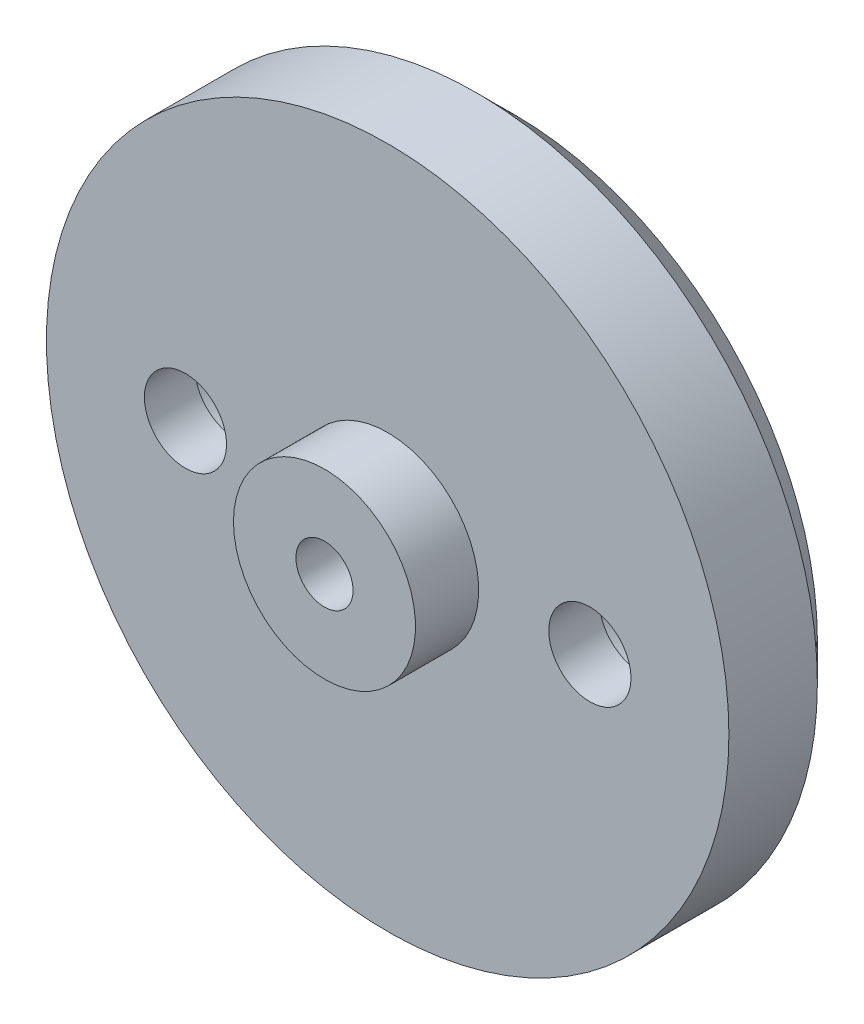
ISO-10303-21;
HEADER;
FILE_DESCRIPTION(('STEP AP214'),'2;1');
FILE_NAME('part.step','',(''),(''),'','','');
FILE_SCHEMA(('AUTOMOTIVE_DESIGN { 1 0 10303 214 1 1 1 1 }'));
ENDSEC;
DATA;
#1=APPLICATION_CONTEXT('core data for automotive mechanical design processes');
#2=APPLICATION_PROTOCOL_DEFINITION('international standard','automotive_design',2000,#1);
#3=PRODUCT_CONTEXT('',#1,'mechanical');
#4=PRODUCT('Part','Part','',(#3));
#5=PRODUCT_RELATED_PRODUCT_CATEGORY('part','',(#4));
#6=PRODUCT_DEFINITION_FORMATION('','',#4);
#7=PRODUCT_DEFINITION_CONTEXT('part definition',#1,'design');
#8=PRODUCT_DEFINITION('design','',#6,#7);
#9=PRODUCT_DEFINITION_SHAPE('','',#8);
#10=(LENGTH_UNIT() NAMED_UNIT(*) SI_UNIT(.MILLI.,.METRE.));
#11=(NAMED_UNIT(*) PLANE_ANGLE_UNIT() SI_UNIT($,.RADIAN.));
#12=(NAMED_UNIT(*) SI_UNIT($,.STERADIAN.) SOLID_ANGLE_UNIT());
#13=UNCERTAINTY_MEASURE_WITH_UNIT(LENGTH_MEASURE(1.E-05),#10,'distance_accuracy_value','');
#14=(GEOMETRIC_REPRESENTATION_CONTEXT(3) GLOBAL_UNCERTAINTY_ASSIGNED_CONTEXT((#13)) GLOBAL_UNIT_ASSIGNED_CONTEXT((#10,
#11,#12)) REPRESENTATION_CONTEXT('',''));
#15=CARTESIAN_POINT('',(0.,0.,0.));
#16=DIRECTION('',(0.,0.,1.));
#17=DIRECTION('',(1.,0.,0.));
#18=AXIS2_PLACEMENT_3D('',#15,#16,#17);
#19=CARTESIAN_POINT('',(0.,0.,12.));
#20=DIRECTION('',(0.,0.,-1.));
#21=DIRECTION('',(0.,-1.,0.));
#22=AXIS2_PLACEMENT_3D('',#19,#20,#21);
#23=PLANE('',#22);
#24=CARTESIAN_POINT('',(0.,0.,12.));
#25=DIRECTION('',(0.,0.,-1.));
#26=DIRECTION('',(-1.,0.,0.));
#27=AXIS2_PLACEMENT_3D('',#24,#25,#26);
#28=CIRCLE('',#27,1.1291);
#29=CARTESIAN_POINT('',(1.1291,0.,12.));
#30=VERTEX_POINT('',#29);
#31=EDGE_CURVE('E11',#30,#30,#28,.T.);
#32=ORIENTED_EDGE('',*,*,#31,.T.);
#33=EDGE_LOOP('',(#32));
#34=FACE_BOUND('',#33,.T.);
#35=CARTESIAN_POINT('',(0.,0.,12.));
#36=DIRECTION('',(0.,0.,1.));
#37=DIRECTION('',(1.,0.,0.));
#38=AXIS2_PLACEMENT_3D('',#35,#36,#37);
#39=CIRCLE('',#38,3.6);
#40=CARTESIAN_POINT('',(-3.6,0.,12.));
#41=VERTEX_POINT('',#40);
#42=EDGE_CURVE('E160',#41,#41,#39,.T.);
#43=ORIENTED_EDGE('',*,*,#42,.T.);
#44=EDGE_LOOP('',(#43));
#45=FACE_BOUND('',#44,.T.);
#46=ADVANCED_FACE('F51',(#34,#45),#23,.F.);
#47=CARTESIAN_POINT('',(0.,0.,12.));
#48=DIRECTION('',(0.,0.,-1.));
#49=DIRECTION('',(-1.,0.,0.));
#50=AXIS2_PLACEMENT_3D('',#47,#48,#49);
#51=CYLINDRICAL_SURFACE('',#50,1.1291);
#52=CARTESIAN_POINT('',(0.,0.,4.5));
#53=DIRECTION('',(0.,0.,1.));
#54=DIRECTION('',(-1.,0.,0.));
#55=AXIS2_PLACEMENT_3D('',#52,#53,#54);
#56=CIRCLE('',#55,1.1291);
#57=CARTESIAN_POINT('',(1.1291,0.,4.5));
#58=VERTEX_POINT('',#57);
#59=EDGE_CURVE('E189',#58,#58,#56,.T.);
#60=ORIENTED_EDGE('',*,*,#59,.F.);
#61=DIRECTION('',(0.,0.,1.));
#62=VECTOR('',#61,1.);
#63=CARTESIAN_POINT('',(1.1291,0.,12.));
#64=LINE('',#63,#62);
#65=EDGE_CURVE('E60',#58,#30,#64,.T.);
#66=ORIENTED_EDGE('',*,*,#65,.T.);
#67=ORIENTED_EDGE('',*,*,#31,.F.);
#68=ORIENTED_EDGE('',*,*,#65,.F.);
#69=EDGE_LOOP('',(#60,#66,#67,#68));
#70=FACE_BOUND('',#69,.T.);
#71=ADVANCED_FACE('F187',(#70),#51,.F.);
#72=CARTESIAN_POINT('',(0.,0.,9.5));
#73=DIRECTION('',(0.,0.,-1.));
#74=DIRECTION('',(0.,-1.,0.));
#75=AXIS2_PLACEMENT_3D('',#72,#73,#74);
#76=PLANE('',#75);
#77=CARTESIAN_POINT('',(0.,0.,9.5));
#78=DIRECTION('',(0.,0.,1.));
#79=DIRECTION('',(1.,0.,0.));
#80=AXIS2_PLACEMENT_3D('',#77,#78,#79);
#81=CIRCLE('',#80,3.6);
#82=CARTESIAN_POINT('',(-3.6,0.,9.5));
#83=VERTEX_POINT('',#82);
#84=EDGE_CURVE('E180',#83,#83,#81,.T.);
#85=ORIENTED_EDGE('',*,*,#84,.F.);
#86=EDGE_LOOP('',(#85));
#87=FACE_BOUND('',#86,.T.);
#88=CARTESIAN_POINT('',(8.,0.,9.5));
#89=DIRECTION('',(0.,0.,-1.));
#90=DIRECTION('',(1.,0.,0.));
#91=AXIS2_PLACEMENT_3D('',#88,#89,#90);
#92=CIRCLE('',#91,1.625);
#93=CARTESIAN_POINT('',(6.375,0.,9.5));
#94=VERTEX_POINT('',#93);
#95=EDGE_CURVE('E138',#94,#94,#92,.T.);
#96=ORIENTED_EDGE('',*,*,#95,.T.);
#97=EDGE_LOOP('',(#96));
#98=FACE_BOUND('',#97,.T.);
#99=CARTESIAN_POINT('',(-8.,0.,9.5));
#100=DIRECTION('',(0.,0.,-1.));
#101=DIRECTION('',(1.,0.,0.));
#102=AXIS2_PLACEMENT_3D('',#99,#100,#101);
#103=CIRCLE('',#102,1.625);
#104=CARTESIAN_POINT('',(-9.625,0.,9.5));
#105=VERTEX_POINT('',#104);
#106=EDGE_CURVE('E153',#105,#105,#103,.T.);
#107=ORIENTED_EDGE('',*,*,#106,.T.);
#108=EDGE_LOOP('',(#107));
#109=FACE_BOUND('',#108,.T.);
#110=CARTESIAN_POINT('',(0.,0.,9.5));
#111=DIRECTION('',(0.,0.,-1.));
#112=DIRECTION('',(-1.,0.,0.));
#113=AXIS2_PLACEMENT_3D('',#110,#111,#112);
#114=CIRCLE('',#113,13.5);
#115=CARTESIAN_POINT('',(13.5,0.,9.5));
#116=VERTEX_POINT('',#115);
#117=EDGE_CURVE('E148',#116,#116,#114,.T.);
#118=ORIENTED_EDGE('',*,*,#117,.F.);
#119=EDGE_LOOP('',(#118));
#120=FACE_BOUND('',#119,.T.);
#121=ADVANCED_FACE('F216',(#87,#98,#109,#120),#76,.F.);
#122=CARTESIAN_POINT('',(0.,0.,12.));
#123=DIRECTION('',(0.,0.,-1.));
#124=DIRECTION('',(1.,0.,0.));
#125=AXIS2_PLACEMENT_3D('',#122,#123,#124);
#126=CYLINDRICAL_SURFACE('',#125,3.6);
#127=ORIENTED_EDGE('',*,*,#42,.F.);
#128=DIRECTION('',(0.,0.,-1.));
#129=VECTOR('',#128,1.);
#130=CARTESIAN_POINT('',(-3.6,0.,12.));
#131=LINE('',#130,#129);
#132=EDGE_CURVE('E164',#41,#83,#131,.T.);
#133=ORIENTED_EDGE('',*,*,#132,.T.);
#134=ORIENTED_EDGE('',*,*,#84,.T.);
#135=ORIENTED_EDGE('',*,*,#132,.F.);
#136=EDGE_LOOP('',(#127,#133,#134,#135));
#137=FACE_BOUND('',#136,.T.);
#138=ADVANCED_FACE('F245',(#137),#126,.T.);
#139=CARTESIAN_POINT('',(8.,0.,7.5));
#140=DIRECTION('',(0.,0.,-1.));
#141=DIRECTION('',(0.,-1.,0.));
#142=AXIS2_PLACEMENT_3D('',#139,#140,#141);
#143=PLANE('',#142);
#144=CARTESIAN_POINT('',(8.,0.,7.5));
#145=DIRECTION('',(0.,0.,1.));
#146=DIRECTION('',(1.,0.,0.));
#147=AXIS2_PLACEMENT_3D('',#144,#145,#146);
#148=CIRCLE('',#147,1.625);
#149=CARTESIAN_POINT('',(6.375,0.,7.5));
#150=VERTEX_POINT('',#149);
#151=EDGE_CURVE('E165',#150,#150,#148,.T.);
#152=ORIENTED_EDGE('',*,*,#151,.T.);
#153=EDGE_LOOP('',(#152));
#154=FACE_BOUND('',#153,.T.);
#155=CARTESIAN_POINT('',(8.,0.,7.5));
#156=DIRECTION('',(0.,0.,1.));
#157=DIRECTION('',(1.,0.,0.));
#158=AXIS2_PLACEMENT_3D('',#155,#156,#157);
#159=CIRCLE('',#158,2.875);
#160=CARTESIAN_POINT('',(5.125,0.,7.5));
#161=VERTEX_POINT('',#160);
#162=EDGE_CURVE('E136',#161,#161,#159,.T.);
#163=ORIENTED_EDGE('',*,*,#162,.F.);
#164=EDGE_LOOP('',(#163));
#165=FACE_BOUND('',#164,.T.);
#166=ADVANCED_FACE('F233',(#154,#165),#143,.T.);
#167=CARTESIAN_POINT('',(8.,0.,4.5));
#168=DIRECTION('',(0.,0.,1.));
#169=DIRECTION('',(1.,0.,0.));
#170=AXIS2_PLACEMENT_3D('',#167,#168,#169);
#171=CYLINDRICAL_SURFACE('',#170,2.875);
#172=CARTESIAN_POINT('',(8.,0.,4.5));
#173=DIRECTION('',(0.,0.,1.));
#174=DIRECTION('',(1.,0.,0.));
#175=AXIS2_PLACEMENT_3D('',#172,#173,#174);
#176=CIRCLE('',#175,2.875);
#177=CARTESIAN_POINT('',(5.125,0.,4.5));
#178=VERTEX_POINT('',#177);
#179=EDGE_CURVE('E194',#178,#178,#176,.T.);
#180=ORIENTED_EDGE('',*,*,#179,.F.);
#181=DIRECTION('',(0.,0.,1.));
#182=VECTOR('',#181,1.);
#183=CARTESIAN_POINT('',(5.125,0.,4.5));
#184=LINE('',#183,#182);
#185=EDGE_CURVE('E130',#178,#161,#184,.T.);
#186=ORIENTED_EDGE('',*,*,#185,.T.);
#187=ORIENTED_EDGE('',*,*,#162,.T.);
#188=ORIENTED_EDGE('',*,*,#185,.F.);
#189=EDGE_LOOP('',(#180,#186,#187,#188));
#190=FACE_BOUND('',#189,.T.);
#191=ADVANCED_FACE('F224',(#190),#171,.F.);
#192=CARTESIAN_POINT('',(-8.,0.,7.5));
#193=DIRECTION('',(0.,0.,-1.));
#194=DIRECTION('',(0.,-1.,0.));
#195=AXIS2_PLACEMENT_3D('',#192,#193,#194);
#196=PLANE('',#195);
#197=CARTESIAN_POINT('',(-8.,0.,7.5));
#198=DIRECTION('',(0.,0.,1.));
#199=DIRECTION('',(1.,0.,0.));
#200=AXIS2_PLACEMENT_3D('',#197,#198,#199);
#201=CIRCLE('',#200,1.625);
#202=CARTESIAN_POINT('',(-9.625,0.,7.5));
#203=VERTEX_POINT('',#202);
#204=EDGE_CURVE('E154',#203,#203,#201,.T.);
#205=ORIENTED_EDGE('',*,*,#204,.T.);
#206=EDGE_LOOP('',(#205));
#207=FACE_BOUND('',#206,.T.);
#208=CARTESIAN_POINT('',(-8.,0.,7.5));
#209=DIRECTION('',(0.,0.,1.));
#210=DIRECTION('',(1.,0.,0.));
#211=AXIS2_PLACEMENT_3D('',#208,#209,#210);
#212=CIRCLE('',#211,2.875);
#213=CARTESIAN_POINT('',(-10.875,0.,7.5));
#214=VERTEX_POINT('',#213);
#215=EDGE_CURVE('E123',#214,#214,#212,.T.);
#216=ORIENTED_EDGE('',*,*,#215,.F.);
#217=EDGE_LOOP('',(#216));
#218=FACE_BOUND('',#217,.T.);
#219=ADVANCED_FACE('F222',(#207,#218),#196,.T.);
#220=CARTESIAN_POINT('',(-8.,0.,4.5));
#221=DIRECTION('',(0.,0.,1.));
#222=DIRECTION('',(1.,0.,0.));
#223=AXIS2_PLACEMENT_3D('',#220,#221,#222);
#224=CYLINDRICAL_SURFACE('',#223,2.875);
#225=CARTESIAN_POINT('',(-8.,0.,4.5));
#226=DIRECTION('',(0.,0.,1.));
#227=DIRECTION('',(1.,0.,0.));
#228=AXIS2_PLACEMENT_3D('',#225,#226,#227);
#229=CIRCLE('',#228,2.875);
#230=CARTESIAN_POINT('',(-10.875,0.,4.5));
#231=VERTEX_POINT('',#230);
#232=EDGE_CURVE('E142',#231,#231,#229,.T.);
#233=ORIENTED_EDGE('',*,*,#232,.F.);
#234=DIRECTION('',(0.,0.,1.));
#235=VECTOR('',#234,1.);
#236=CARTESIAN_POINT('',(-10.875,0.,4.5));
#237=LINE('',#236,#235);
#238=EDGE_CURVE('E126',#231,#214,#237,.T.);
#239=ORIENTED_EDGE('',*,*,#238,.T.);
#240=ORIENTED_EDGE('',*,*,#215,.T.);
#241=ORIENTED_EDGE('',*,*,#238,.F.);
#242=EDGE_LOOP('',(#233,#239,#240,#241));
#243=FACE_BOUND('',#242,.T.);
#244=ADVANCED_FACE('F125',(#243),#224,.F.);
#245=CARTESIAN_POINT('',(8.,0.,4.5));
#246=DIRECTION('',(0.,0.,1.));
#247=DIRECTION('',(1.,0.,0.));
#248=AXIS2_PLACEMENT_3D('',#245,#246,#247);
#249=CYLINDRICAL_SURFACE('',#248,1.625);
#250=ORIENTED_EDGE('',*,*,#151,.F.);
#251=DIRECTION('',(0.,0.,1.));
#252=VECTOR('',#251,1.);
#253=CARTESIAN_POINT('',(6.375,0.,4.5));
#254=LINE('',#253,#252);
#255=EDGE_CURVE('E169',#150,#94,#254,.T.);
#256=ORIENTED_EDGE('',*,*,#255,.T.);
#257=ORIENTED_EDGE('',*,*,#95,.F.);
#258=ORIENTED_EDGE('',*,*,#255,.F.);
#259=EDGE_LOOP('',(#250,#256,#257,#258));
#260=FACE_BOUND('',#259,.T.);
#261=ADVANCED_FACE('F231',(#260),#249,.F.);
#262=CARTESIAN_POINT('',(-8.,0.,4.5));
#263=DIRECTION('',(0.,0.,1.));
#264=DIRECTION('',(1.,0.,0.));
#265=AXIS2_PLACEMENT_3D('',#262,#263,#264);
#266=CYLINDRICAL_SURFACE('',#265,1.625);
#267=ORIENTED_EDGE('',*,*,#204,.F.);
#268=DIRECTION('',(0.,0.,1.));
#269=VECTOR('',#268,1.);
#270=CARTESIAN_POINT('',(-9.625,0.,4.5));
#271=LINE('',#270,#269);
#272=EDGE_CURVE('E149',#203,#105,#271,.T.);
#273=ORIENTED_EDGE('',*,*,#272,.T.);
#274=ORIENTED_EDGE('',*,*,#106,.F.);
#275=ORIENTED_EDGE('',*,*,#272,.F.);
#276=EDGE_LOOP('',(#267,#273,#274,#275));
#277=FACE_BOUND('',#276,.T.);
#278=ADVANCED_FACE('F220',(#277),#266,.F.);
#279=CARTESIAN_POINT('',(0.,0.,12.));
#280=DIRECTION('',(0.,0.,-1.));
#281=DIRECTION('',(-1.,0.,0.));
#282=AXIS2_PLACEMENT_3D('',#279,#280,#281);
#283=CYLINDRICAL_SURFACE('',#282,13.5);
#284=CARTESIAN_POINT('',(0.,0.,6.));
#285=DIRECTION('',(0.,0.,-1.));
#286=DIRECTION('',(-1.,0.,0.));
#287=AXIS2_PLACEMENT_3D('',#284,#285,#286);
#288=CIRCLE('',#287,13.5);
#289=CARTESIAN_POINT('',(13.5,0.,6.));
#290=VERTEX_POINT('',#289);
#291=EDGE_CURVE('E195',#290,#290,#288,.T.);
#292=ORIENTED_EDGE('',*,*,#291,.F.);
#293=DIRECTION('',(0.,0.,1.));
#294=VECTOR('',#293,1.);
#295=CARTESIAN_POINT('',(13.5,0.,12.));
#296=LINE('',#295,#294);
#297=EDGE_CURVE('E144',#290,#116,#296,.T.);
#298=ORIENTED_EDGE('',*,*,#297,.T.);
#299=ORIENTED_EDGE('',*,*,#117,.T.);
#300=ORIENTED_EDGE('',*,*,#297,.F.);
#301=EDGE_LOOP('',(#292,#298,#299,#300));
#302=FACE_BOUND('',#301,.T.);
#303=ADVANCED_FACE('F263',(#302),#283,.T.);
#304=CARTESIAN_POINT('',(0.,0.,4.5));
#305=DIRECTION('',(0.,0.,1.));
#306=DIRECTION('',(1.,0.,0.));
#307=AXIS2_PLACEMENT_3D('',#304,#305,#306);
#308=PLANE('',#307);
#309=ORIENTED_EDGE('',*,*,#232,.T.);
#310=EDGE_LOOP('',(#309));
#311=FACE_BOUND('',#310,.T.);
#312=ORIENTED_EDGE('',*,*,#179,.T.);
#313=EDGE_LOOP('',(#312));
#314=FACE_BOUND('',#313,.T.);
#315=ORIENTED_EDGE('',*,*,#59,.T.);
#316=EDGE_LOOP('',(#315));
#317=FACE_BOUND('',#316,.T.);
#318=CARTESIAN_POINT('',(0.,0.,4.5));
#319=DIRECTION('',(0.,0.,1.));
#320=DIRECTION('',(-1.,0.,0.));
#321=AXIS2_PLACEMENT_3D('',#318,#319,#320);
#322=CIRCLE('',#321,12.);
#323=CARTESIAN_POINT('',(12.,0.,4.5));
#324=VERTEX_POINT('',#323);
#325=EDGE_CURVE('E206',#324,#324,#322,.T.);
#326=ORIENTED_EDGE('',*,*,#325,.F.);
#327=EDGE_LOOP('',(#326));
#328=FACE_BOUND('',#327,.T.);
#329=ADVANCED_FACE('F191',(#311,#314,#317,#328),#308,.F.);
#330=CARTESIAN_POINT('',(0.,0.,5.25));
#331=DIRECTION('',(0.,0.,1.));
#332=DIRECTION('',(-1.,0.,0.));
#333=AXIS2_PLACEMENT_3D('',#330,#331,#332);
#334=CONICAL_SURFACE('',#333,12.75,0.785398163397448);
#335=ORIENTED_EDGE('',*,*,#325,.T.);
#336=DIRECTION('',(0.707106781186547,0.,0.707106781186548));
#337=VECTOR('',#336,1.);
#338=CARTESIAN_POINT('',(12.75,0.,5.25));
#339=LINE('',#338,#337);
#340=EDGE_CURVE('E203',#324,#290,#339,.T.);
#341=ORIENTED_EDGE('',*,*,#340,.T.);
#342=ORIENTED_EDGE('',*,*,#291,.T.);
#343=ORIENTED_EDGE('',*,*,#340,.F.);
#344=EDGE_LOOP('',(#335,#341,#342,#343));
#345=FACE_BOUND('',#344,.T.);
#346=ADVANCED_FACE('F262',(#345),#334,.T.);
#347=CLOSED_SHELL('',(#46,#71,#121,#138,#166,#191,#219,#244,#261,#278,#303,#329,#346));
#348=MANIFOLD_SOLID_BREP('B2',#347);
#349=ADVANCED_BREP_SHAPE_REPRESENTATION('',(#18,#348),#14);
#350=SHAPE_DEFINITION_REPRESENTATION(#9,#349);
ENDSEC;
END-ISO-10303-21;
